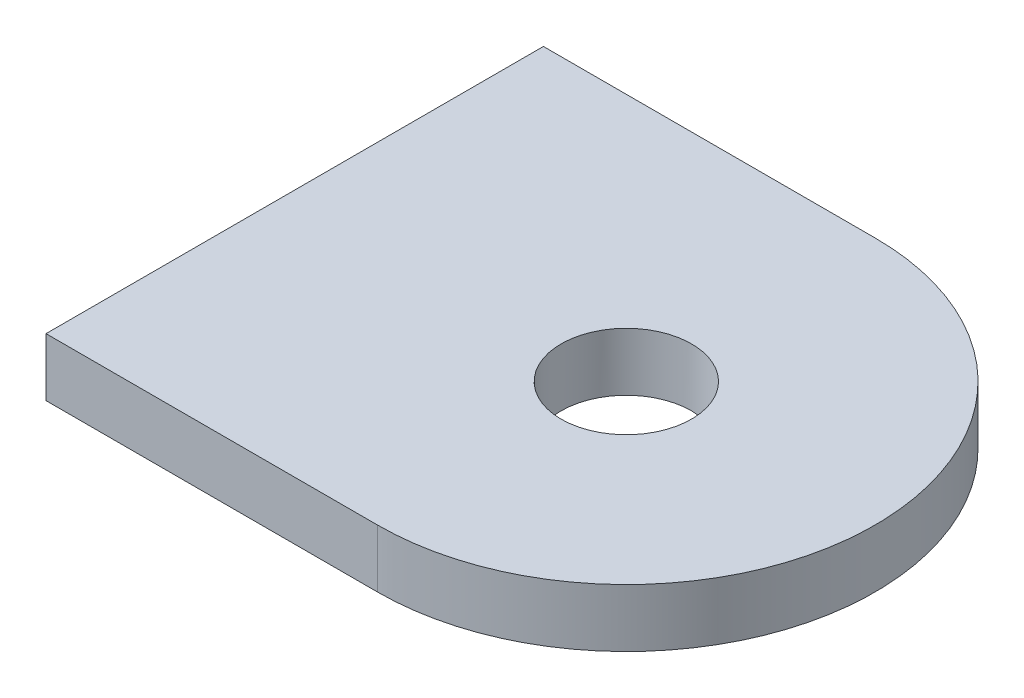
ISO-10303-21;
HEADER;
FILE_DESCRIPTION(('STEP AP214'),'2;1');
FILE_NAME('part.step','',(''),(''),'','','');
FILE_SCHEMA(('AUTOMOTIVE_DESIGN { 1 0 10303 214 1 1 1 1 }'));
ENDSEC;
DATA;
#1=APPLICATION_CONTEXT('core data for automotive mechanical design processes');
#2=APPLICATION_PROTOCOL_DEFINITION('international standard','automotive_design',2000,#1);
#3=PRODUCT_CONTEXT('',#1,'mechanical');
#4=PRODUCT('Part','Part','',(#3));
#5=PRODUCT_RELATED_PRODUCT_CATEGORY('part','',(#4));
#6=PRODUCT_DEFINITION_FORMATION('','',#4);
#7=PRODUCT_DEFINITION_CONTEXT('part definition',#1,'design');
#8=PRODUCT_DEFINITION('design','',#6,#7);
#9=PRODUCT_DEFINITION_SHAPE('','',#8);
#10=(LENGTH_UNIT() NAMED_UNIT(*) SI_UNIT(.MILLI.,.METRE.));
#11=(NAMED_UNIT(*) PLANE_ANGLE_UNIT() SI_UNIT($,.RADIAN.));
#12=(NAMED_UNIT(*) SI_UNIT($,.STERADIAN.) SOLID_ANGLE_UNIT());
#13=UNCERTAINTY_MEASURE_WITH_UNIT(LENGTH_MEASURE(1.E-05),#10,'distance_accuracy_value','');
#14=(GEOMETRIC_REPRESENTATION_CONTEXT(3) GLOBAL_UNCERTAINTY_ASSIGNED_CONTEXT((#13)) GLOBAL_UNIT_ASSIGNED_CONTEXT((#10,
#11,#12)) REPRESENTATION_CONTEXT('',''));
#15=CARTESIAN_POINT('',(0.,0.,0.));
#16=DIRECTION('',(0.,0.,1.));
#17=DIRECTION('',(1.,0.,0.));
#18=AXIS2_PLACEMENT_3D('',#15,#16,#17);
#19=CARTESIAN_POINT('',(50.8,8.89,0.));
#20=DIRECTION('',(0.,0.,-1.));
#21=DIRECTION('',(-1.,0.,0.));
#22=AXIS2_PLACEMENT_3D('',#19,#20,#21);
#23=PLANE('',#22);
#24=DIRECTION('',(1.,0.,0.));
#25=VECTOR('',#24,1.);
#26=CARTESIAN_POINT('',(50.8,0.,0.));
#27=LINE('',#26,#25);
#28=CARTESIAN_POINT('',(0.,0.,0.));
#29=VERTEX_POINT('',#28);
#30=CARTESIAN_POINT('',(50.8,0.,0.));
#31=VERTEX_POINT('',#30);
#32=EDGE_CURVE('E98',#29,#31,#27,.T.);
#33=ORIENTED_EDGE('',*,*,#32,.T.);
#34=DIRECTION('',(0.,-1.,0.));
#35=VECTOR('',#34,1.);
#36=CARTESIAN_POINT('',(50.8,8.89,0.));
#37=LINE('',#36,#35);
#38=CARTESIAN_POINT('',(50.8,8.89,0.));
#39=VERTEX_POINT('',#38);
#40=EDGE_CURVE('E11',#39,#31,#37,.T.);
#41=ORIENTED_EDGE('',*,*,#40,.F.);
#42=DIRECTION('',(1.,0.,0.));
#43=VECTOR('',#42,1.);
#44=CARTESIAN_POINT('',(50.8,8.89,0.));
#45=LINE('',#44,#43);
#46=CARTESIAN_POINT('',(0.,8.89,0.));
#47=VERTEX_POINT('',#46);
#48=EDGE_CURVE('E85',#47,#39,#45,.T.);
#49=ORIENTED_EDGE('',*,*,#48,.F.);
#50=DIRECTION('',(0.,-1.,0.));
#51=VECTOR('',#50,1.);
#52=CARTESIAN_POINT('',(0.,8.89,0.));
#53=LINE('',#52,#51);
#54=EDGE_CURVE('E94',#47,#29,#53,.T.);
#55=ORIENTED_EDGE('',*,*,#54,.T.);
#56=EDGE_LOOP('',(#33,#41,#49,#55));
#57=FACE_BOUND('',#56,.T.);
#58=ADVANCED_FACE('F33',(#57),#23,.F.);
#59=CARTESIAN_POINT('',(50.8,8.89,-38.1));
#60=DIRECTION('',(0.,-1.,0.));
#61=DIRECTION('',(0.,0.,-1.));
#62=AXIS2_PLACEMENT_3D('',#59,#60,#61);
#63=CYLINDRICAL_SURFACE('',#62,38.1);
#64=CARTESIAN_POINT('',(50.8,0.,-38.1));
#65=DIRECTION('',(0.,1.,0.));
#66=DIRECTION('',(0.,0.,-1.));
#67=AXIS2_PLACEMENT_3D('',#64,#65,#66);
#68=CIRCLE('',#67,38.1);
#69=CARTESIAN_POINT('',(50.8,0.,-76.2));
#70=VERTEX_POINT('',#69);
#71=EDGE_CURVE('E89',#31,#70,#68,.T.);
#72=ORIENTED_EDGE('',*,*,#71,.T.);
#73=DIRECTION('',(0.,-1.,0.));
#74=VECTOR('',#73,1.);
#75=CARTESIAN_POINT('',(50.8,8.89,-76.2));
#76=LINE('',#75,#74);
#77=CARTESIAN_POINT('',(50.8,8.89,-76.2));
#78=VERTEX_POINT('',#77);
#79=EDGE_CURVE('E42',#78,#70,#76,.T.);
#80=ORIENTED_EDGE('',*,*,#79,.F.);
#81=CARTESIAN_POINT('',(50.8,8.89,-38.1));
#82=DIRECTION('',(0.,1.,0.));
#83=DIRECTION('',(0.,0.,-1.));
#84=AXIS2_PLACEMENT_3D('',#81,#82,#83);
#85=CIRCLE('',#84,38.1);
#86=EDGE_CURVE('E80',#39,#78,#85,.T.);
#87=ORIENTED_EDGE('',*,*,#86,.F.);
#88=ORIENTED_EDGE('',*,*,#40,.T.);
#89=EDGE_LOOP('',(#72,#80,#87,#88));
#90=FACE_BOUND('',#89,.T.);
#91=ADVANCED_FACE('F88',(#90),#63,.T.);
#92=CARTESIAN_POINT('',(0.,8.89,-76.2));
#93=DIRECTION('',(0.,0.,1.));
#94=DIRECTION('',(1.,0.,0.));
#95=AXIS2_PLACEMENT_3D('',#92,#93,#94);
#96=PLANE('',#95);
#97=DIRECTION('',(-1.,0.,0.));
#98=VECTOR('',#97,1.);
#99=CARTESIAN_POINT('',(0.,0.,-76.2));
#100=LINE('',#99,#98);
#101=CARTESIAN_POINT('',(0.,0.,-76.2));
#102=VERTEX_POINT('',#101);
#103=EDGE_CURVE('E67',#70,#102,#100,.T.);
#104=ORIENTED_EDGE('',*,*,#103,.T.);
#105=DIRECTION('',(0.,-1.,0.));
#106=VECTOR('',#105,1.);
#107=CARTESIAN_POINT('',(0.,8.89,-76.2));
#108=LINE('',#107,#106);
#109=CARTESIAN_POINT('',(0.,8.89,-76.2));
#110=VERTEX_POINT('',#109);
#111=EDGE_CURVE('E90',#110,#102,#108,.T.);
#112=ORIENTED_EDGE('',*,*,#111,.F.);
#113=DIRECTION('',(-1.,0.,0.));
#114=VECTOR('',#113,1.);
#115=CARTESIAN_POINT('',(0.,8.89,-76.2));
#116=LINE('',#115,#114);
#117=EDGE_CURVE('E83',#78,#110,#116,.T.);
#118=ORIENTED_EDGE('',*,*,#117,.F.);
#119=ORIENTED_EDGE('',*,*,#79,.T.);
#120=EDGE_LOOP('',(#104,#112,#118,#119));
#121=FACE_BOUND('',#120,.T.);
#122=ADVANCED_FACE('F92',(#121),#96,.F.);
#123=CARTESIAN_POINT('',(0.,8.89,0.));
#124=DIRECTION('',(1.,0.,0.));
#125=DIRECTION('',(0.,0.,-1.));
#126=AXIS2_PLACEMENT_3D('',#123,#124,#125);
#127=PLANE('',#126);
#128=DIRECTION('',(0.,0.,1.));
#129=VECTOR('',#128,1.);
#130=CARTESIAN_POINT('',(0.,0.,0.));
#131=LINE('',#130,#129);
#132=EDGE_CURVE('E73',#102,#29,#131,.T.);
#133=ORIENTED_EDGE('',*,*,#132,.T.);
#134=ORIENTED_EDGE('',*,*,#54,.F.);
#135=DIRECTION('',(0.,0.,1.));
#136=VECTOR('',#135,1.);
#137=CARTESIAN_POINT('',(0.,8.89,0.));
#138=LINE('',#137,#136);
#139=EDGE_CURVE('E50',#110,#47,#138,.T.);
#140=ORIENTED_EDGE('',*,*,#139,.F.);
#141=ORIENTED_EDGE('',*,*,#111,.T.);
#142=EDGE_LOOP('',(#133,#134,#140,#141));
#143=FACE_BOUND('',#142,.T.);
#144=ADVANCED_FACE('F105',(#143),#127,.F.);
#145=CARTESIAN_POINT('',(50.8,8.89,-38.1));
#146=DIRECTION('',(0.,-1.,0.));
#147=DIRECTION('',(0.,0.,-1.));
#148=AXIS2_PLACEMENT_3D('',#145,#146,#147);
#149=PLANE('',#148);
#150=CARTESIAN_POINT('',(50.8,8.89,-38.1));
#151=DIRECTION('',(0.,1.,0.));
#152=DIRECTION('',(0.,0.,1.));
#153=AXIS2_PLACEMENT_3D('',#150,#151,#152);
#154=CIRCLE('',#153,9.98998305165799);
#155=CARTESIAN_POINT('',(50.8,8.89,-28.110016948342));
#156=VERTEX_POINT('',#155);
#157=EDGE_CURVE('E111',#156,#156,#154,.T.);
#158=ORIENTED_EDGE('',*,*,#157,.F.);
#159=EDGE_LOOP('',(#158));
#160=FACE_BOUND('',#159,.T.);
#161=ORIENTED_EDGE('',*,*,#48,.T.);
#162=ORIENTED_EDGE('',*,*,#86,.T.);
#163=ORIENTED_EDGE('',*,*,#117,.T.);
#164=ORIENTED_EDGE('',*,*,#139,.T.);
#165=EDGE_LOOP('',(#161,#162,#163,#164));
#166=FACE_BOUND('',#165,.T.);
#167=ADVANCED_FACE('F81',(#160,#166),#149,.F.);
#168=CARTESIAN_POINT('',(50.8,0.,-38.1));
#169=DIRECTION('',(0.,-1.,0.));
#170=DIRECTION('',(0.,0.,-1.));
#171=AXIS2_PLACEMENT_3D('',#168,#169,#170);
#172=PLANE('',#171);
#173=CARTESIAN_POINT('',(50.8,0.,-38.1));
#174=DIRECTION('',(0.,-1.,0.));
#175=DIRECTION('',(0.,0.,-1.));
#176=AXIS2_PLACEMENT_3D('',#173,#174,#175);
#177=CIRCLE('',#176,9.98998305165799);
#178=CARTESIAN_POINT('',(50.8,0.,-48.089983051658));
#179=VERTEX_POINT('',#178);
#180=EDGE_CURVE('E36',#179,#179,#177,.T.);
#181=ORIENTED_EDGE('',*,*,#180,.F.);
#182=EDGE_LOOP('',(#181));
#183=FACE_BOUND('',#182,.T.);
#184=ORIENTED_EDGE('',*,*,#32,.F.);
#185=ORIENTED_EDGE('',*,*,#132,.F.);
#186=ORIENTED_EDGE('',*,*,#103,.F.);
#187=ORIENTED_EDGE('',*,*,#71,.F.);
#188=EDGE_LOOP('',(#184,#185,#186,#187));
#189=FACE_BOUND('',#188,.T.);
#190=ADVANCED_FACE('F108',(#183,#189),#172,.T.);
#191=CARTESIAN_POINT('',(50.8,-34.036,-38.1));
#192=DIRECTION('',(0.,1.,0.));
#193=DIRECTION('',(0.,0.,1.));
#194=AXIS2_PLACEMENT_3D('',#191,#192,#193);
#195=CYLINDRICAL_SURFACE('',#194,9.98998305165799);
#196=ORIENTED_EDGE('',*,*,#180,.T.);
#197=EDGE_LOOP('',(#196));
#198=FACE_BOUND('',#197,.T.);
#199=ORIENTED_EDGE('',*,*,#157,.T.);
#200=EDGE_LOOP('',(#199));
#201=FACE_BOUND('',#200,.T.);
#202=ADVANCED_FACE('F118',(#198,#201),#195,.F.);
#203=CLOSED_SHELL('',(#58,#91,#122,#144,#167,#190,#202));
#204=MANIFOLD_SOLID_BREP('B2',#203);
#205=ADVANCED_BREP_SHAPE_REPRESENTATION('',(#18,#204),#14);
#206=SHAPE_DEFINITION_REPRESENTATION(#9,#205);
ENDSEC;
END-ISO-10303-21;
